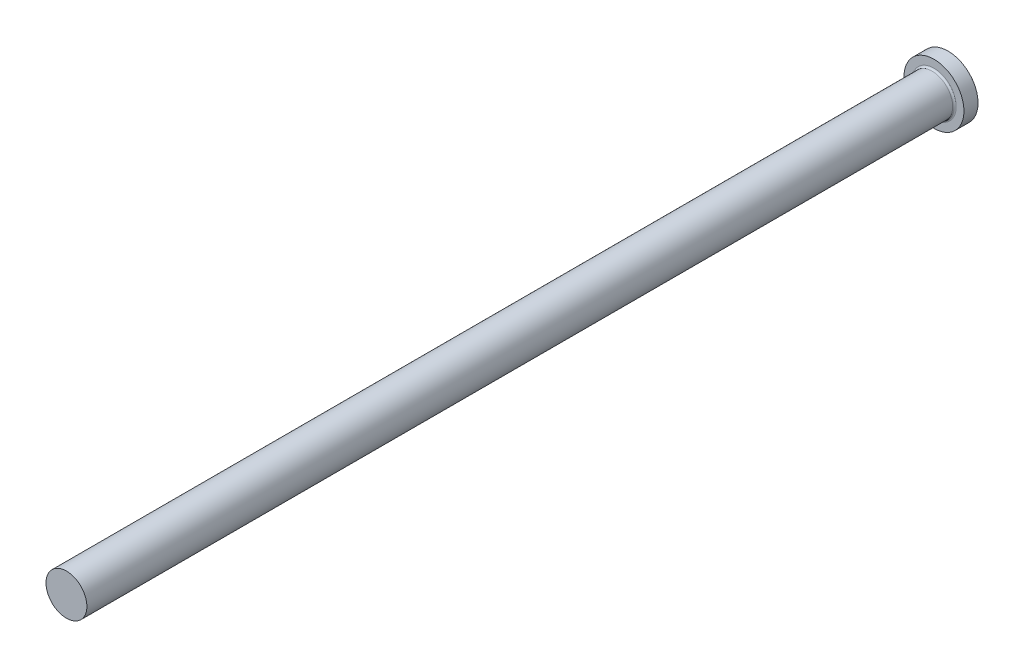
ISO-10303-21;
HEADER;
FILE_DESCRIPTION(('STEP AP214'),'2;1');
FILE_NAME('part.step','',(''),(''),'','','');
FILE_SCHEMA(('AUTOMOTIVE_DESIGN { 1 0 10303 214 1 1 1 1 }'));
ENDSEC;
DATA;
#1=APPLICATION_CONTEXT('core data for automotive mechanical design processes');
#2=APPLICATION_PROTOCOL_DEFINITION('international standard','automotive_design',2000,#1);
#3=PRODUCT_CONTEXT('',#1,'mechanical');
#4=PRODUCT('Part','Part','',(#3));
#5=PRODUCT_RELATED_PRODUCT_CATEGORY('part','',(#4));
#6=PRODUCT_DEFINITION_FORMATION('','',#4);
#7=PRODUCT_DEFINITION_CONTEXT('part definition',#1,'design');
#8=PRODUCT_DEFINITION('design','',#6,#7);
#9=PRODUCT_DEFINITION_SHAPE('','',#8);
#10=(LENGTH_UNIT() NAMED_UNIT(*) SI_UNIT(.MILLI.,.METRE.));
#11=(NAMED_UNIT(*) PLANE_ANGLE_UNIT() SI_UNIT($,.RADIAN.));
#12=(NAMED_UNIT(*) SI_UNIT($,.STERADIAN.) SOLID_ANGLE_UNIT());
#13=UNCERTAINTY_MEASURE_WITH_UNIT(LENGTH_MEASURE(1.E-05),#10,'distance_accuracy_value','');
#14=(GEOMETRIC_REPRESENTATION_CONTEXT(3) GLOBAL_UNCERTAINTY_ASSIGNED_CONTEXT((#13)) GLOBAL_UNIT_ASSIGNED_CONTEXT((#10,
#11,#12)) REPRESENTATION_CONTEXT('',''));
#15=CARTESIAN_POINT('',(0.,0.,0.));
#16=DIRECTION('',(0.,0.,1.));
#17=DIRECTION('',(1.,0.,0.));
#18=AXIS2_PLACEMENT_3D('',#15,#16,#17);
#19=CARTESIAN_POINT('',(8.5,0.,4.));
#20=DIRECTION('',(0.,0.,-1.));
#21=DIRECTION('',(-1.,0.,0.));
#22=AXIS2_PLACEMENT_3D('',#19,#20,#21);
#23=PLANE('',#22);
#24=CARTESIAN_POINT('',(0.,0.,4.));
#25=DIRECTION('',(0.,0.,-1.));
#26=DIRECTION('',(-1.,0.,0.));
#27=AXIS2_PLACEMENT_3D('',#24,#25,#26);
#28=CIRCLE('',#27,6.30000000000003);
#29=CARTESIAN_POINT('',(-6.30000000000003,0.,4.));
#30=VERTEX_POINT('',#29);
#31=EDGE_CURVE('E40',#30,#30,#28,.T.);
#32=ORIENTED_EDGE('',*,*,#31,.T.);
#33=EDGE_LOOP('',(#32));
#34=FACE_BOUND('',#33,.T.);
#35=CARTESIAN_POINT('',(0.,0.,4.));
#36=DIRECTION('',(0.,0.,-1.));
#37=DIRECTION('',(-1.,0.,0.));
#38=AXIS2_PLACEMENT_3D('',#35,#36,#37);
#39=CIRCLE('',#38,8.5);
#40=CARTESIAN_POINT('',(-8.5,0.,4.));
#41=VERTEX_POINT('',#40);
#42=EDGE_CURVE('E44',#41,#41,#39,.T.);
#43=ORIENTED_EDGE('',*,*,#42,.F.);
#44=EDGE_LOOP('',(#43));
#45=FACE_BOUND('',#44,.T.);
#46=ADVANCED_FACE('F33',(#34,#45),#23,.F.);
#47=CARTESIAN_POINT('',(0.,0.,-9.03322817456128));
#48=DIRECTION('',(0.,0.,-1.));
#49=DIRECTION('',(-1.,0.,0.));
#50=AXIS2_PLACEMENT_3D('',#47,#48,#49);
#51=CYLINDRICAL_SURFACE('',#50,8.5);
#52=CARTESIAN_POINT('',(0.,0.,0.));
#53=DIRECTION('',(0.,0.,-1.));
#54=DIRECTION('',(-1.,0.,0.));
#55=AXIS2_PLACEMENT_3D('',#52,#53,#54);
#56=CIRCLE('',#55,8.5);
#57=CARTESIAN_POINT('',(-8.5,0.,0.));
#58=VERTEX_POINT('',#57);
#59=EDGE_CURVE('E48',#58,#58,#56,.T.);
#60=ORIENTED_EDGE('',*,*,#59,.F.);
#61=EDGE_LOOP('',(#60));
#62=FACE_BOUND('',#61,.T.);
#63=ORIENTED_EDGE('',*,*,#42,.T.);
#64=EDGE_LOOP('',(#63));
#65=FACE_BOUND('',#64,.T.);
#66=ADVANCED_FACE('F68',(#62,#65),#51,.T.);
#67=CARTESIAN_POINT('',(0.,0.,0.));
#68=DIRECTION('',(0.,0.,1.));
#69=DIRECTION('',(1.,0.,0.));
#70=AXIS2_PLACEMENT_3D('',#67,#68,#69);
#71=PLANE('',#70);
#72=ORIENTED_EDGE('',*,*,#59,.T.);
#73=EDGE_LOOP('',(#72));
#74=FACE_BOUND('',#73,.T.);
#75=ADVANCED_FACE('F61',(#74),#71,.F.);
#76=CARTESIAN_POINT('',(0.,0.,250.));
#77=DIRECTION('',(0.,0.,-1.));
#78=DIRECTION('',(-1.,0.,0.));
#79=AXIS2_PLACEMENT_3D('',#76,#77,#78);
#80=PLANE('',#79);
#81=CARTESIAN_POINT('',(0.,0.,250.));
#82=DIRECTION('',(0.,0.,-1.));
#83=DIRECTION('',(-1.,0.,0.));
#84=AXIS2_PLACEMENT_3D('',#81,#82,#83);
#85=CIRCLE('',#84,5.80000000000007);
#86=CARTESIAN_POINT('',(-5.80000000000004,0.,250.));
#87=VERTEX_POINT('',#86);
#88=EDGE_CURVE('E53',#87,#87,#85,.T.);
#89=ORIENTED_EDGE('',*,*,#88,.F.);
#90=EDGE_LOOP('',(#89));
#91=FACE_BOUND('',#90,.T.);
#92=ADVANCED_FACE('F59',(#91),#80,.F.);
#93=CARTESIAN_POINT('',(0.,0.,-9.03322817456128));
#94=DIRECTION('',(0.,0.,-1.));
#95=DIRECTION('',(-1.,0.,0.));
#96=AXIS2_PLACEMENT_3D('',#93,#94,#95);
#97=CYLINDRICAL_SURFACE('',#96,5.80000000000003);
#98=CARTESIAN_POINT('',(0.,0.,4.5));
#99=DIRECTION('',(0.,0.,-1.));
#100=DIRECTION('',(-1.,0.,0.));
#101=AXIS2_PLACEMENT_3D('',#98,#99,#100);
#102=CIRCLE('',#101,5.80000000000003);
#103=CARTESIAN_POINT('',(-5.80000000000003,0.,4.5));
#104=VERTEX_POINT('',#103);
#105=EDGE_CURVE('E10',#104,#104,#102,.F.);
#106=ORIENTED_EDGE('',*,*,#105,.T.);
#107=EDGE_LOOP('',(#106));
#108=FACE_BOUND('',#107,.T.);
#109=ORIENTED_EDGE('',*,*,#88,.T.);
#110=EDGE_LOOP('',(#109));
#111=FACE_BOUND('',#110,.T.);
#112=ADVANCED_FACE('F57',(#108,#111),#97,.T.);
#113=CARTESIAN_POINT('',(0.,0.,4.5));
#114=DIRECTION('',(0.,0.,-1.));
#115=DIRECTION('',(-1.,0.,0.));
#116=AXIS2_PLACEMENT_3D('',#113,#114,#115);
#117=TOROIDAL_SURFACE('',#116,6.30000000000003,0.5);
#118=ORIENTED_EDGE('',*,*,#105,.F.);
#119=EDGE_LOOP('',(#118));
#120=FACE_BOUND('',#119,.T.);
#121=ORIENTED_EDGE('',*,*,#31,.F.);
#122=EDGE_LOOP('',(#121));
#123=FACE_BOUND('',#122,.T.);
#124=ADVANCED_FACE('F35',(#120,#123),#117,.F.);
#125=CLOSED_SHELL('',(#46,#66,#75,#92,#112,#124));
#126=MANIFOLD_SOLID_BREP('B2',#125);
#127=ADVANCED_BREP_SHAPE_REPRESENTATION('',(#18,#126),#14);
#128=SHAPE_DEFINITION_REPRESENTATION(#9,#127);
ENDSEC;
END-ISO-10303-21;
